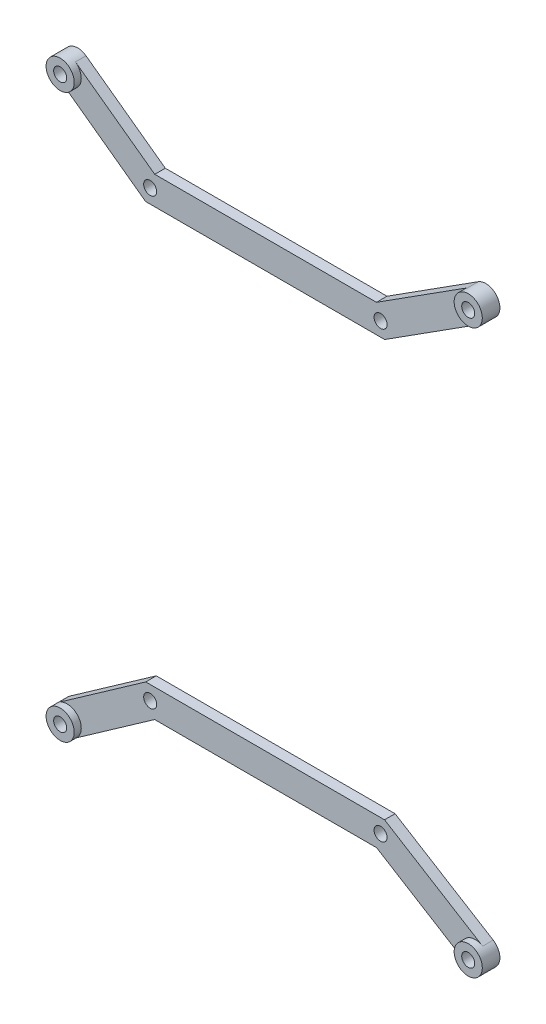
ISO-10303-21;
HEADER;
FILE_DESCRIPTION(('STEP AP214'),'2;1');
FILE_NAME('part.step','',(''),(''),'','','');
FILE_SCHEMA(('AUTOMOTIVE_DESIGN { 1 0 10303 214 1 1 1 1 }'));
ENDSEC;
DATA;
#1=APPLICATION_CONTEXT('core data for automotive mechanical design processes');
#2=APPLICATION_PROTOCOL_DEFINITION('international standard','automotive_design',2000,#1);
#3=PRODUCT_CONTEXT('',#1,'mechanical');
#4=PRODUCT('Part','Part','',(#3));
#5=PRODUCT_RELATED_PRODUCT_CATEGORY('part','',(#4));
#6=PRODUCT_DEFINITION_FORMATION('','',#4);
#7=PRODUCT_DEFINITION_CONTEXT('part definition',#1,'design');
#8=PRODUCT_DEFINITION('design','',#6,#7);
#9=PRODUCT_DEFINITION_SHAPE('','',#8);
#10=(LENGTH_UNIT() NAMED_UNIT(*) SI_UNIT(.MILLI.,.METRE.));
#11=(NAMED_UNIT(*) PLANE_ANGLE_UNIT() SI_UNIT($,.RADIAN.));
#12=(NAMED_UNIT(*) SI_UNIT($,.STERADIAN.) SOLID_ANGLE_UNIT());
#13=UNCERTAINTY_MEASURE_WITH_UNIT(LENGTH_MEASURE(1.E-05),#10,'distance_accuracy_value','');
#14=(GEOMETRIC_REPRESENTATION_CONTEXT(3) GLOBAL_UNCERTAINTY_ASSIGNED_CONTEXT((#13)) GLOBAL_UNIT_ASSIGNED_CONTEXT((#10,
#11,#12)) REPRESENTATION_CONTEXT('',''));
#15=CARTESIAN_POINT('',(0.,0.,0.));
#16=DIRECTION('',(0.,0.,1.));
#17=DIRECTION('',(1.,0.,0.));
#18=AXIS2_PLACEMENT_3D('',#15,#16,#17);
#19=CARTESIAN_POINT('',(58.633927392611,81.359461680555,0.));
#20=DIRECTION('',(0.,0.,-1.));
#21=DIRECTION('',(-1.,0.,0.));
#22=AXIS2_PLACEMENT_3D('',#19,#20,#21);
#23=PLANE('',#22);
#24=CARTESIAN_POINT('',(-33.7767777,64.19002176,0.));
#25=DIRECTION('',(0.,0.,1.));
#26=DIRECTION('',(-1.,0.,0.));
#27=AXIS2_PLACEMENT_3D('',#24,#25,#26);
#28=CIRCLE('',#27,1.85000000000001);
#29=CARTESIAN_POINT('',(-35.6267777,64.19002176,0.));
#30=VERTEX_POINT('',#29);
#31=EDGE_CURVE('E58',#30,#30,#28,.T.);
#32=ORIENTED_EDGE('',*,*,#31,.F.);
#33=EDGE_LOOP('',(#32));
#34=FACE_BOUND('',#33,.T.);
#35=CARTESIAN_POINT('',(31.7132223,64.19002176,0.));
#36=DIRECTION('',(0.,0.,1.));
#37=DIRECTION('',(-1.,0.,0.));
#38=AXIS2_PLACEMENT_3D('',#35,#36,#37);
#39=CIRCLE('',#38,1.85000000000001);
#40=CARTESIAN_POINT('',(29.8632223,64.19002176,0.));
#41=VERTEX_POINT('',#40);
#42=EDGE_CURVE('E174',#41,#41,#39,.T.);
#43=ORIENTED_EDGE('',*,*,#42,.F.);
#44=EDGE_LOOP('',(#43));
#45=FACE_BOUND('',#44,.T.);
#46=CARTESIAN_POINT('',(-57.366072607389,81.359461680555,0.));
#47=DIRECTION('',(0.,0.,1.));
#48=DIRECTION('',(1.,0.,0.));
#49=AXIS2_PLACEMENT_3D('',#46,#47,#48);
#50=CIRCLE('',#49,4.00000000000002);
#51=CARTESIAN_POINT('',(-59.7199777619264,78.1254037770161,0.));
#52=VERTEX_POINT('',#51);
#53=CARTESIAN_POINT('',(-55.0121674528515,84.5935195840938,0.));
#54=VERTEX_POINT('',#53);
#55=EDGE_CURVE('E254',#52,#54,#50,.T.);
#56=ORIENTED_EDGE('',*,*,#55,.F.);
#57=DIRECTION('',(0.808514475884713,-0.588476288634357,0.));
#58=VECTOR('',#57,1.);
#59=CARTESIAN_POINT('',(-35.0783460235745,60.19002176,0.));
#60=LINE('',#59,#58);
#61=CARTESIAN_POINT('',(-35.0783460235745,60.19002176,0.));
#62=VERTEX_POINT('',#61);
#63=EDGE_CURVE('E145',#52,#62,#60,.T.);
#64=ORIENTED_EDGE('',*,*,#63,.T.);
#65=DIRECTION('',(1.,0.,0.));
#66=VECTOR('',#65,1.);
#67=CARTESIAN_POINT('',(32.8802084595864,60.19002176,0.));
#68=LINE('',#67,#66);
#69=CARTESIAN_POINT('',(32.8802084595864,60.19002176,0.));
#70=VERTEX_POINT('',#69);
#71=EDGE_CURVE('E126',#62,#70,#68,.T.);
#72=ORIENTED_EDGE('',*,*,#71,.T.);
#73=DIRECTION('',(0.843120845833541,0.537724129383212,0.));
#74=VECTOR('',#73,1.);
#75=CARTESIAN_POINT('',(60.7848239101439,77.9869782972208,0.));
#76=LINE('',#75,#74);
#77=CARTESIAN_POINT('',(60.7848239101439,77.9869782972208,0.));
#78=VERTEX_POINT('',#77);
#79=EDGE_CURVE('E137',#70,#78,#76,.T.);
#80=ORIENTED_EDGE('',*,*,#79,.T.);
#81=CARTESIAN_POINT('',(58.633927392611,81.359461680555,0.));
#82=DIRECTION('',(0.,0.,1.));
#83=DIRECTION('',(1.,0.,0.));
#84=AXIS2_PLACEMENT_3D('',#81,#82,#83);
#85=CIRCLE('',#84,4.00000000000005);
#86=CARTESIAN_POINT('',(56.4830308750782,84.7319450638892,0.));
#87=VERTEX_POINT('',#86);
#88=EDGE_CURVE('E257',#87,#78,#85,.T.);
#89=ORIENTED_EDGE('',*,*,#88,.F.);
#90=DIRECTION('',(-0.843120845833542,-0.537724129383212,0.));
#91=VECTOR('',#90,1.);
#92=CARTESIAN_POINT('',(30.5462361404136,68.19002176,0.));
#93=LINE('',#92,#91);
#94=CARTESIAN_POINT('',(30.5462361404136,68.19002176,0.));
#95=VERTEX_POINT('',#94);
#96=EDGE_CURVE('E142',#87,#95,#93,.T.);
#97=ORIENTED_EDGE('',*,*,#96,.T.);
#98=DIRECTION('',(-1.,0.,0.));
#99=VECTOR('',#98,1.);
#100=CARTESIAN_POINT('',(-32.4752093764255,68.19002176,0.));
#101=LINE('',#100,#99);
#102=CARTESIAN_POINT('',(-32.4752093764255,68.19002176,0.));
#103=VERTEX_POINT('',#102);
#104=EDGE_CURVE('E170',#95,#103,#101,.T.);
#105=ORIENTED_EDGE('',*,*,#104,.T.);
#106=DIRECTION('',(-0.808514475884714,0.588476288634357,0.));
#107=VECTOR('',#106,1.);
#108=CARTESIAN_POINT('',(-55.0121674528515,84.5935195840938,0.));
#109=LINE('',#108,#107);
#110=EDGE_CURVE('E147',#103,#54,#109,.T.);
#111=ORIENTED_EDGE('',*,*,#110,.T.);
#112=EDGE_LOOP('',(#56,#64,#72,#80,#89,#97,#105,#111));
#113=FACE_BOUND('',#112,.T.);
#114=ADVANCED_FACE('F49',(#34,#45,#113),#23,.F.);
#115=CARTESIAN_POINT('',(-55.0121674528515,84.5935195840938,-3.));
#116=DIRECTION('',(0.588476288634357,0.808514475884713,0.));
#117=DIRECTION('',(-0.808514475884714,0.588476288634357,0.));
#118=AXIS2_PLACEMENT_3D('',#115,#116,#117);
#119=PLANE('',#118);
#120=ORIENTED_EDGE('',*,*,#110,.F.);
#121=DIRECTION('',(0.,0.,1.));
#122=VECTOR('',#121,1.);
#123=CARTESIAN_POINT('',(-32.4752093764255,68.19002176,-3.));
#124=LINE('',#123,#122);
#125=CARTESIAN_POINT('',(-32.4752093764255,68.19002176,-3.));
#126=VERTEX_POINT('',#125);
#127=EDGE_CURVE('E110',#126,#103,#124,.T.);
#128=ORIENTED_EDGE('',*,*,#127,.F.);
#129=DIRECTION('',(-0.808514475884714,0.588476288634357,0.));
#130=VECTOR('',#129,1.);
#131=CARTESIAN_POINT('',(-55.0121674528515,84.5935195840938,-3.));
#132=LINE('',#131,#130);
#133=CARTESIAN_POINT('',(-55.0121674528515,84.5935195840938,-3.));
#134=VERTEX_POINT('',#133);
#135=EDGE_CURVE('E168',#126,#134,#132,.T.);
#136=ORIENTED_EDGE('',*,*,#135,.T.);
#137=DIRECTION('',(0.,0.,1.));
#138=VECTOR('',#137,1.);
#139=CARTESIAN_POINT('',(-55.0121674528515,84.5935195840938,-3.));
#140=LINE('',#139,#138);
#141=EDGE_CURVE('E66',#134,#54,#140,.T.);
#142=ORIENTED_EDGE('',*,*,#141,.T.);
#143=EDGE_LOOP('',(#120,#128,#136,#142));
#144=FACE_BOUND('',#143,.T.);
#145=ADVANCED_FACE('F195',(#144),#119,.T.);
#146=CARTESIAN_POINT('',(-32.4752093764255,68.19002176,-3.));
#147=DIRECTION('',(0.,1.,0.));
#148=DIRECTION('',(0.,0.,1.));
#149=AXIS2_PLACEMENT_3D('',#146,#147,#148);
#150=PLANE('',#149);
#151=ORIENTED_EDGE('',*,*,#104,.F.);
#152=DIRECTION('',(0.,0.,1.));
#153=VECTOR('',#152,1.);
#154=CARTESIAN_POINT('',(30.5462361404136,68.19002176,-3.));
#155=LINE('',#154,#153);
#156=CARTESIAN_POINT('',(30.5462361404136,68.19002176,-3.));
#157=VERTEX_POINT('',#156);
#158=EDGE_CURVE('E273',#157,#95,#155,.T.);
#159=ORIENTED_EDGE('',*,*,#158,.F.);
#160=DIRECTION('',(-1.,0.,0.));
#161=VECTOR('',#160,1.);
#162=CARTESIAN_POINT('',(-32.4752093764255,68.19002176,-3.));
#163=LINE('',#162,#161);
#164=EDGE_CURVE('E153',#157,#126,#163,.T.);
#165=ORIENTED_EDGE('',*,*,#164,.T.);
#166=ORIENTED_EDGE('',*,*,#127,.T.);
#167=EDGE_LOOP('',(#151,#159,#165,#166));
#168=FACE_BOUND('',#167,.T.);
#169=ADVANCED_FACE('F214',(#168),#150,.T.);
#170=CARTESIAN_POINT('',(30.5462361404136,68.19002176,-3.));
#171=DIRECTION('',(-0.537724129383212,0.843120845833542,0.));
#172=DIRECTION('',(-0.843120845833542,-0.537724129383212,0.));
#173=AXIS2_PLACEMENT_3D('',#170,#171,#172);
#174=PLANE('',#173);
#175=ORIENTED_EDGE('',*,*,#96,.F.);
#176=DIRECTION('',(0.,0.,1.));
#177=VECTOR('',#176,1.);
#178=CARTESIAN_POINT('',(56.4830308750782,84.7319450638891,-3.));
#179=LINE('',#178,#177);
#180=CARTESIAN_POINT('',(56.4830308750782,84.7319450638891,-3.));
#181=VERTEX_POINT('',#180);
#182=EDGE_CURVE('E270',#181,#87,#179,.T.);
#183=ORIENTED_EDGE('',*,*,#182,.F.);
#184=DIRECTION('',(-0.843120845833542,-0.537724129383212,0.));
#185=VECTOR('',#184,1.);
#186=CARTESIAN_POINT('',(30.5462361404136,68.19002176,-3.));
#187=LINE('',#186,#185);
#188=EDGE_CURVE('E155',#181,#157,#187,.T.);
#189=ORIENTED_EDGE('',*,*,#188,.T.);
#190=ORIENTED_EDGE('',*,*,#158,.T.);
#191=EDGE_LOOP('',(#175,#183,#189,#190));
#192=FACE_BOUND('',#191,.T.);
#193=ADVANCED_FACE('F217',(#192),#174,.T.);
#194=CARTESIAN_POINT('',(58.633927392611,81.359461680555,-3.));
#195=DIRECTION('',(0.,0.,1.));
#196=DIRECTION('',(1.,0.,0.));
#197=AXIS2_PLACEMENT_3D('',#194,#195,#196);
#198=CYLINDRICAL_SURFACE('',#197,4.);
#199=ORIENTED_EDGE('',*,*,#182,.T.);
#200=ORIENTED_EDGE('',*,*,#88,.T.);
#201=DIRECTION('',(0.,0.,1.));
#202=VECTOR('',#201,1.);
#203=CARTESIAN_POINT('',(60.7848239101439,77.9869782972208,-3.));
#204=LINE('',#203,#202);
#205=CARTESIAN_POINT('',(60.7848239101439,77.9869782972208,-3.));
#206=VERTEX_POINT('',#205);
#207=EDGE_CURVE('E134',#206,#78,#204,.T.);
#208=ORIENTED_EDGE('',*,*,#207,.F.);
#209=CARTESIAN_POINT('',(58.633927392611,81.359461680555,-3.));
#210=DIRECTION('',(0.,0.,1.));
#211=DIRECTION('',(-1.,0.,0.));
#212=AXIS2_PLACEMENT_3D('',#209,#210,#211);
#213=CIRCLE('',#212,4.);
#214=EDGE_CURVE('E158',#206,#181,#213,.T.);
#215=ORIENTED_EDGE('',*,*,#214,.T.);
#216=EDGE_LOOP('',(#199,#200,#208,#215));
#217=FACE_BOUND('',#216,.T.);
#218=CARTESIAN_POINT('',(58.633927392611,81.359461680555,2.));
#219=DIRECTION('',(0.,0.,1.));
#220=DIRECTION('',(1.,0.,0.));
#221=AXIS2_PLACEMENT_3D('',#218,#219,#220);
#222=CIRCLE('',#221,4.00000000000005);
#223=CARTESIAN_POINT('',(62.6339273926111,81.359461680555,2.));
#224=VERTEX_POINT('',#223);
#225=EDGE_CURVE('E253',#224,#224,#222,.T.);
#226=ORIENTED_EDGE('',*,*,#225,.F.);
#227=EDGE_LOOP('',(#226));
#228=FACE_BOUND('',#227,.T.);
#229=ADVANCED_FACE('F220',(#217,#228),#198,.T.);
#230=CARTESIAN_POINT('',(60.7848239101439,77.9869782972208,-3.));
#231=DIRECTION('',(0.537724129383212,-0.843120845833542,0.));
#232=DIRECTION('',(0.843120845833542,0.537724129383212,0.));
#233=AXIS2_PLACEMENT_3D('',#230,#231,#232);
#234=PLANE('',#233);
#235=ORIENTED_EDGE('',*,*,#79,.F.);
#236=DIRECTION('',(0.,0.,1.));
#237=VECTOR('',#236,1.);
#238=CARTESIAN_POINT('',(32.8802084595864,60.19002176,-3.));
#239=LINE('',#238,#237);
#240=CARTESIAN_POINT('',(32.8802084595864,60.19002176,-3.));
#241=VERTEX_POINT('',#240);
#242=EDGE_CURVE('E122',#241,#70,#239,.T.);
#243=ORIENTED_EDGE('',*,*,#242,.F.);
#244=DIRECTION('',(0.843120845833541,0.537724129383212,0.));
#245=VECTOR('',#244,1.);
#246=CARTESIAN_POINT('',(60.7848239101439,77.9869782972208,-3.));
#247=LINE('',#246,#245);
#248=EDGE_CURVE('E161',#241,#206,#247,.T.);
#249=ORIENTED_EDGE('',*,*,#248,.T.);
#250=ORIENTED_EDGE('',*,*,#207,.T.);
#251=EDGE_LOOP('',(#235,#243,#249,#250));
#252=FACE_BOUND('',#251,.T.);
#253=ADVANCED_FACE('F138',(#252),#234,.T.);
#254=CARTESIAN_POINT('',(32.8802084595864,60.19002176,-3.));
#255=DIRECTION('',(0.,-1.,0.));
#256=DIRECTION('',(0.,0.,-1.));
#257=AXIS2_PLACEMENT_3D('',#254,#255,#256);
#258=PLANE('',#257);
#259=ORIENTED_EDGE('',*,*,#71,.F.);
#260=DIRECTION('',(0.,0.,1.));
#261=VECTOR('',#260,1.);
#262=CARTESIAN_POINT('',(-35.0783460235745,60.19002176,-3.));
#263=LINE('',#262,#261);
#264=CARTESIAN_POINT('',(-35.0783460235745,60.19002176,-3.));
#265=VERTEX_POINT('',#264);
#266=EDGE_CURVE('E133',#265,#62,#263,.T.);
#267=ORIENTED_EDGE('',*,*,#266,.F.);
#268=DIRECTION('',(1.,0.,0.));
#269=VECTOR('',#268,1.);
#270=CARTESIAN_POINT('',(32.8802084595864,60.19002176,-3.));
#271=LINE('',#270,#269);
#272=EDGE_CURVE('E129',#265,#241,#271,.T.);
#273=ORIENTED_EDGE('',*,*,#272,.T.);
#274=ORIENTED_EDGE('',*,*,#242,.T.);
#275=EDGE_LOOP('',(#259,#267,#273,#274));
#276=FACE_BOUND('',#275,.T.);
#277=ADVANCED_FACE('F124',(#276),#258,.T.);
#278=CARTESIAN_POINT('',(-35.0783460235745,60.19002176,-3.));
#279=DIRECTION('',(-0.588476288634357,-0.808514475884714,0.));
#280=DIRECTION('',(0.808514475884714,-0.588476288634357,0.));
#281=AXIS2_PLACEMENT_3D('',#278,#279,#280);
#282=PLANE('',#281);
#283=ORIENTED_EDGE('',*,*,#63,.F.);
#284=DIRECTION('',(0.,0.,1.));
#285=VECTOR('',#284,1.);
#286=CARTESIAN_POINT('',(-59.7199777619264,78.1254037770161,-3.));
#287=LINE('',#286,#285);
#288=CARTESIAN_POINT('',(-59.7199777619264,78.1254037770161,-3.));
#289=VERTEX_POINT('',#288);
#290=EDGE_CURVE('E97',#289,#52,#287,.T.);
#291=ORIENTED_EDGE('',*,*,#290,.F.);
#292=DIRECTION('',(0.808514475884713,-0.588476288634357,0.));
#293=VECTOR('',#292,1.);
#294=CARTESIAN_POINT('',(-35.0783460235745,60.19002176,-3.));
#295=LINE('',#294,#293);
#296=EDGE_CURVE('E164',#289,#265,#295,.T.);
#297=ORIENTED_EDGE('',*,*,#296,.T.);
#298=ORIENTED_EDGE('',*,*,#266,.T.);
#299=EDGE_LOOP('',(#283,#291,#297,#298));
#300=FACE_BOUND('',#299,.T.);
#301=ADVANCED_FACE('F229',(#300),#282,.T.);
#302=CARTESIAN_POINT('',(-57.366072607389,81.359461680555,-3.));
#303=DIRECTION('',(0.,0.,1.));
#304=DIRECTION('',(1.,0.,0.));
#305=AXIS2_PLACEMENT_3D('',#302,#303,#304);
#306=CYLINDRICAL_SURFACE('',#305,4.00000000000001);
#307=ORIENTED_EDGE('',*,*,#290,.T.);
#308=ORIENTED_EDGE('',*,*,#55,.T.);
#309=ORIENTED_EDGE('',*,*,#141,.F.);
#310=CARTESIAN_POINT('',(-57.366072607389,81.359461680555,-3.));
#311=DIRECTION('',(0.,0.,1.));
#312=DIRECTION('',(-1.,0.,0.));
#313=AXIS2_PLACEMENT_3D('',#310,#311,#312);
#314=CIRCLE('',#313,4.00000000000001);
#315=EDGE_CURVE('E166',#134,#289,#314,.T.);
#316=ORIENTED_EDGE('',*,*,#315,.T.);
#317=EDGE_LOOP('',(#307,#308,#309,#316));
#318=FACE_BOUND('',#317,.T.);
#319=CARTESIAN_POINT('',(-57.366072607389,81.359461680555,2.));
#320=DIRECTION('',(0.,0.,1.));
#321=DIRECTION('',(1.,0.,0.));
#322=AXIS2_PLACEMENT_3D('',#319,#320,#321);
#323=CIRCLE('',#322,4.00000000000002);
#324=CARTESIAN_POINT('',(-53.3660726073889,81.359461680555,2.));
#325=VERTEX_POINT('',#324);
#326=EDGE_CURVE('E248',#325,#325,#323,.T.);
#327=ORIENTED_EDGE('',*,*,#326,.F.);
#328=EDGE_LOOP('',(#327));
#329=FACE_BOUND('',#328,.T.);
#330=ADVANCED_FACE('F211',(#318,#329),#306,.T.);
#331=CARTESIAN_POINT('',(58.633927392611,81.359461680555,-3.));
#332=DIRECTION('',(0.,0.,-1.));
#333=DIRECTION('',(-1.,0.,0.));
#334=AXIS2_PLACEMENT_3D('',#331,#332,#333);
#335=PLANE('',#334);
#336=CARTESIAN_POINT('',(-57.366072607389,81.359461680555,-3.));
#337=DIRECTION('',(0.,0.,1.));
#338=DIRECTION('',(1.,0.,0.));
#339=AXIS2_PLACEMENT_3D('',#336,#337,#338);
#340=CIRCLE('',#339,1.85000000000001);
#341=CARTESIAN_POINT('',(-55.516072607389,81.359461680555,-3.));
#342=VERTEX_POINT('',#341);
#343=EDGE_CURVE('E12',#342,#342,#340,.T.);
#344=ORIENTED_EDGE('',*,*,#343,.T.);
#345=EDGE_LOOP('',(#344));
#346=FACE_BOUND('',#345,.T.);
#347=CARTESIAN_POINT('',(-33.7767777,64.19002176,-3.));
#348=DIRECTION('',(0.,0.,1.));
#349=DIRECTION('',(-1.,0.,0.));
#350=AXIS2_PLACEMENT_3D('',#347,#348,#349);
#351=CIRCLE('',#350,1.85000000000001);
#352=CARTESIAN_POINT('',(-35.6267777,64.19002176,-3.));
#353=VERTEX_POINT('',#352);
#354=EDGE_CURVE('E177',#353,#353,#351,.T.);
#355=ORIENTED_EDGE('',*,*,#354,.T.);
#356=EDGE_LOOP('',(#355));
#357=FACE_BOUND('',#356,.T.);
#358=CARTESIAN_POINT('',(31.7132223,64.19002176,-3.));
#359=DIRECTION('',(0.,0.,1.));
#360=DIRECTION('',(-1.,0.,0.));
#361=AXIS2_PLACEMENT_3D('',#358,#359,#360);
#362=CIRCLE('',#361,1.85000000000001);
#363=CARTESIAN_POINT('',(29.8632223,64.19002176,-3.));
#364=VERTEX_POINT('',#363);
#365=EDGE_CURVE('E173',#364,#364,#362,.T.);
#366=ORIENTED_EDGE('',*,*,#365,.T.);
#367=EDGE_LOOP('',(#366));
#368=FACE_BOUND('',#367,.T.);
#369=CARTESIAN_POINT('',(58.633927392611,81.359461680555,-3.));
#370=DIRECTION('',(0.,0.,1.));
#371=DIRECTION('',(1.,0.,0.));
#372=AXIS2_PLACEMENT_3D('',#369,#370,#371);
#373=CIRCLE('',#372,1.85000000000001);
#374=CARTESIAN_POINT('',(60.4839273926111,81.359461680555,-3.));
#375=VERTEX_POINT('',#374);
#376=EDGE_CURVE('E152',#375,#375,#373,.T.);
#377=ORIENTED_EDGE('',*,*,#376,.T.);
#378=EDGE_LOOP('',(#377));
#379=FACE_BOUND('',#378,.T.);
#380=ORIENTED_EDGE('',*,*,#135,.F.);
#381=ORIENTED_EDGE('',*,*,#164,.F.);
#382=ORIENTED_EDGE('',*,*,#188,.F.);
#383=ORIENTED_EDGE('',*,*,#214,.F.);
#384=ORIENTED_EDGE('',*,*,#248,.F.);
#385=ORIENTED_EDGE('',*,*,#272,.F.);
#386=ORIENTED_EDGE('',*,*,#296,.F.);
#387=ORIENTED_EDGE('',*,*,#315,.F.);
#388=EDGE_LOOP('',(#380,#381,#382,#383,#384,#385,#386,#387));
#389=FACE_BOUND('',#388,.T.);
#390=ADVANCED_FACE('F184',(#346,#357,#368,#379,#389),#335,.T.);
#391=CARTESIAN_POINT('',(58.633927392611,81.359461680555,-3.));
#392=DIRECTION('',(0.,0.,1.));
#393=DIRECTION('',(1.,0.,0.));
#394=AXIS2_PLACEMENT_3D('',#391,#392,#393);
#395=CYLINDRICAL_SURFACE('',#394,1.85000000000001);
#396=ORIENTED_EDGE('',*,*,#376,.F.);
#397=EDGE_LOOP('',(#396));
#398=FACE_BOUND('',#397,.T.);
#399=CARTESIAN_POINT('',(58.633927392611,81.359461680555,2.));
#400=DIRECTION('',(0.,0.,1.));
#401=DIRECTION('',(1.,0.,0.));
#402=AXIS2_PLACEMENT_3D('',#399,#400,#401);
#403=CIRCLE('',#402,1.85000000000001);
#404=CARTESIAN_POINT('',(60.4839273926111,81.359461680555,2.));
#405=VERTEX_POINT('',#404);
#406=EDGE_CURVE('E262',#405,#405,#403,.T.);
#407=ORIENTED_EDGE('',*,*,#406,.T.);
#408=EDGE_LOOP('',(#407));
#409=FACE_BOUND('',#408,.T.);
#410=ADVANCED_FACE('F200',(#398,#409),#395,.F.);
#411=CARTESIAN_POINT('',(31.7132223,64.19002176,-3.));
#412=DIRECTION('',(0.,0.,1.));
#413=DIRECTION('',(1.,0.,0.));
#414=AXIS2_PLACEMENT_3D('',#411,#412,#413);
#415=CYLINDRICAL_SURFACE('',#414,1.85000000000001);
#416=ORIENTED_EDGE('',*,*,#365,.F.);
#417=EDGE_LOOP('',(#416));
#418=FACE_BOUND('',#417,.T.);
#419=ORIENTED_EDGE('',*,*,#42,.T.);
#420=EDGE_LOOP('',(#419));
#421=FACE_BOUND('',#420,.T.);
#422=ADVANCED_FACE('F190',(#418,#421),#415,.F.);
#423=CARTESIAN_POINT('',(-33.7767777,64.19002176,-3.));
#424=DIRECTION('',(0.,0.,1.));
#425=DIRECTION('',(1.,0.,0.));
#426=AXIS2_PLACEMENT_3D('',#423,#424,#425);
#427=CYLINDRICAL_SURFACE('',#426,1.85000000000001);
#428=ORIENTED_EDGE('',*,*,#354,.F.);
#429=EDGE_LOOP('',(#428));
#430=FACE_BOUND('',#429,.T.);
#431=ORIENTED_EDGE('',*,*,#31,.T.);
#432=EDGE_LOOP('',(#431));
#433=FACE_BOUND('',#432,.T.);
#434=ADVANCED_FACE('F187',(#430,#433),#427,.F.);
#435=CARTESIAN_POINT('',(-57.366072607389,81.359461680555,-3.));
#436=DIRECTION('',(0.,0.,1.));
#437=DIRECTION('',(1.,0.,0.));
#438=AXIS2_PLACEMENT_3D('',#435,#436,#437);
#439=CYLINDRICAL_SURFACE('',#438,1.85000000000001);
#440=ORIENTED_EDGE('',*,*,#343,.F.);
#441=EDGE_LOOP('',(#440));
#442=FACE_BOUND('',#441,.T.);
#443=CARTESIAN_POINT('',(-57.366072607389,81.359461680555,2.));
#444=DIRECTION('',(0.,0.,1.));
#445=DIRECTION('',(1.,0.,0.));
#446=AXIS2_PLACEMENT_3D('',#443,#444,#445);
#447=CIRCLE('',#446,1.85000000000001);
#448=CARTESIAN_POINT('',(-55.516072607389,81.359461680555,2.));
#449=VERTEX_POINT('',#448);
#450=EDGE_CURVE('E251',#449,#449,#447,.T.);
#451=ORIENTED_EDGE('',*,*,#450,.T.);
#452=EDGE_LOOP('',(#451));
#453=FACE_BOUND('',#452,.T.);
#454=ADVANCED_FACE('F51',(#442,#453),#439,.F.);
#455=CARTESIAN_POINT('',(58.633927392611,81.359461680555,2.));
#456=DIRECTION('',(0.,0.,1.));
#457=DIRECTION('',(1.,0.,0.));
#458=AXIS2_PLACEMENT_3D('',#455,#456,#457);
#459=PLANE('',#458);
#460=ORIENTED_EDGE('',*,*,#225,.T.);
#461=EDGE_LOOP('',(#460));
#462=FACE_BOUND('',#461,.T.);
#463=ORIENTED_EDGE('',*,*,#406,.F.);
#464=EDGE_LOOP('',(#463));
#465=FACE_BOUND('',#464,.T.);
#466=ADVANCED_FACE('F236',(#462,#465),#459,.T.);
#467=CARTESIAN_POINT('',(-57.366072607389,81.359461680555,2.));
#468=DIRECTION('',(0.,0.,1.));
#469=DIRECTION('',(1.,0.,0.));
#470=AXIS2_PLACEMENT_3D('',#467,#468,#469);
#471=PLANE('',#470);
#472=ORIENTED_EDGE('',*,*,#326,.T.);
#473=EDGE_LOOP('',(#472));
#474=FACE_BOUND('',#473,.T.);
#475=ORIENTED_EDGE('',*,*,#450,.F.);
#476=EDGE_LOOP('',(#475));
#477=FACE_BOUND('',#476,.T.);
#478=ADVANCED_FACE('F239',(#474,#477),#471,.T.);
#479=CLOSED_SHELL('',(#114,#145,#169,#193,#229,#253,#277,#301,#330,#390,#410,#422,#434,#454,
#466,#478));
#480=MANIFOLD_SOLID_BREP('B2',#479);
#481=CARTESIAN_POINT('',(-57.366072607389,-78.640538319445,0.));
#482=DIRECTION('',(0.,0.,1.));
#483=DIRECTION('',(1.,0.,0.));
#484=AXIS2_PLACEMENT_3D('',#481,#482,#483);
#485=PLANE('',#484);
#486=CARTESIAN_POINT('',(-33.7767777,-62.05997824,0.));
#487=DIRECTION('',(0.,0.,1.));
#488=DIRECTION('',(1.,0.,0.));
#489=AXIS2_PLACEMENT_3D('',#486,#487,#488);
#490=CIRCLE('',#489,1.85000000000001);
#491=CARTESIAN_POINT('',(-31.9267777,-62.05997824,0.));
#492=VERTEX_POINT('',#491);
#493=EDGE_CURVE('E607',#492,#492,#490,.T.);
#494=ORIENTED_EDGE('',*,*,#493,.F.);
#495=EDGE_LOOP('',(#494));
#496=FACE_BOUND('',#495,.T.);
#497=CARTESIAN_POINT('',(31.7132223,-62.05997824,0.));
#498=DIRECTION('',(0.,0.,1.));
#499=DIRECTION('',(1.,0.,0.));
#500=AXIS2_PLACEMENT_3D('',#497,#498,#499);
#501=CIRCLE('',#500,1.85);
#502=CARTESIAN_POINT('',(33.5632223,-62.05997824,0.));
#503=VERTEX_POINT('',#502);
#504=EDGE_CURVE('E603',#503,#503,#501,.T.);
#505=ORIENTED_EDGE('',*,*,#504,.F.);
#506=EDGE_LOOP('',(#505));
#507=FACE_BOUND('',#506,.T.);
#508=DIRECTION('',(0.851461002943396,-0.524417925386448,0.));
#509=VECTOR('',#508,1.);
#510=CARTESIAN_POINT('',(30.580240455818,-66.05997824,0.));
#511=LINE('',#510,#509);
#512=CARTESIAN_POINT('',(30.580240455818,-66.05997824,0.));
#513=VERTEX_POINT('',#512);
#514=CARTESIAN_POINT('',(56.5362556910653,-82.0463823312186,0.));
#515=VERTEX_POINT('',#514);
#516=EDGE_CURVE('E513',#513,#515,#511,.T.);
#517=ORIENTED_EDGE('',*,*,#516,.T.);
#518=CARTESIAN_POINT('',(58.6339273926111,-78.640538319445,0.));
#519=DIRECTION('',(0.,0.,1.));
#520=DIRECTION('',(1.,0.,0.));
#521=AXIS2_PLACEMENT_3D('',#518,#519,#520);
#522=CIRCLE('',#521,4.00000000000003);
#523=CARTESIAN_POINT('',(60.7315990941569,-75.2346943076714,0.));
#524=VERTEX_POINT('',#523);
#525=EDGE_CURVE('E587',#524,#515,#522,.T.);
#526=ORIENTED_EDGE('',*,*,#525,.F.);
#527=DIRECTION('',(-0.851461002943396,0.524417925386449,0.));
#528=VECTOR('',#527,1.);
#529=CARTESIAN_POINT('',(60.7315990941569,-75.2346943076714,0.));
#530=LINE('',#529,#528);
#531=CARTESIAN_POINT('',(32.846204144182,-58.05997824,0.));
#532=VERTEX_POINT('',#531);
#533=EDGE_CURVE('E479',#524,#532,#530,.T.);
#534=ORIENTED_EDGE('',*,*,#533,.T.);
#535=DIRECTION('',(-1.,0.,0.));
#536=VECTOR('',#535,1.);
#537=CARTESIAN_POINT('',(32.846204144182,-58.05997824,0.));
#538=LINE('',#537,#536);
#539=CARTESIAN_POINT('',(-35.0419193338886,-58.05997824,0.));
#540=VERTEX_POINT('',#539);
#541=EDGE_CURVE('E517',#532,#540,#538,.T.);
#542=ORIENTED_EDGE('',*,*,#541,.T.);
#543=DIRECTION('',(-0.818121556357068,-0.575045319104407,0.));
#544=VECTOR('',#543,1.);
#545=CARTESIAN_POINT('',(-35.0419193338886,-58.05997824,0.));
#546=LINE('',#545,#544);
#547=CARTESIAN_POINT('',(-59.6662538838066,-75.3680520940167,0.));
#548=VERTEX_POINT('',#547);
#549=EDGE_CURVE('E503',#540,#548,#546,.T.);
#550=ORIENTED_EDGE('',*,*,#549,.T.);
#551=CARTESIAN_POINT('',(-57.366072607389,-78.640538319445,0.));
#552=DIRECTION('',(0.,0.,1.));
#553=DIRECTION('',(1.,0.,0.));
#554=AXIS2_PLACEMENT_3D('',#551,#552,#553);
#555=CIRCLE('',#554,4.00000000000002);
#556=CARTESIAN_POINT('',(-55.0658913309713,-81.9130245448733,0.));
#557=VERTEX_POINT('',#556);
#558=EDGE_CURVE('E47',#557,#548,#555,.T.);
#559=ORIENTED_EDGE('',*,*,#558,.F.);
#560=DIRECTION('',(0.818121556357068,0.575045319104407,0.));
#561=VECTOR('',#560,1.);
#562=CARTESIAN_POINT('',(-55.0658913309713,-81.9130245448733,0.));
#563=LINE('',#562,#561);
#564=CARTESIAN_POINT('',(-32.5116360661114,-66.05997824,0.));
#565=VERTEX_POINT('',#564);
#566=EDGE_CURVE('E506',#557,#565,#563,.T.);
#567=ORIENTED_EDGE('',*,*,#566,.T.);
#568=DIRECTION('',(1.,0.,0.));
#569=VECTOR('',#568,1.);
#570=CARTESIAN_POINT('',(-32.5116360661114,-66.05997824,0.));
#571=LINE('',#570,#569);
#572=EDGE_CURVE('E510',#565,#513,#571,.T.);
#573=ORIENTED_EDGE('',*,*,#572,.T.);
#574=EDGE_LOOP('',(#517,#526,#534,#542,#550,#559,#567,#573));
#575=FACE_BOUND('',#574,.T.);
#576=ADVANCED_FACE('F403',(#496,#507,#575),#485,.T.);
#577=CARTESIAN_POINT('',(-35.0419193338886,-58.05997824,-3.));
#578=DIRECTION('',(-0.575045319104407,0.818121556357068,0.));
#579=DIRECTION('',(-0.818121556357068,-0.575045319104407,0.));
#580=AXIS2_PLACEMENT_3D('',#577,#578,#579);
#581=PLANE('',#580);
#582=ORIENTED_EDGE('',*,*,#549,.F.);
#583=DIRECTION('',(0.,0.,1.));
#584=VECTOR('',#583,1.);
#585=CARTESIAN_POINT('',(-35.0419193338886,-58.05997824,-3.));
#586=LINE('',#585,#584);
#587=CARTESIAN_POINT('',(-35.0419193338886,-58.05997824,-3.));
#588=VERTEX_POINT('',#587);
#589=EDGE_CURVE('E413',#588,#540,#586,.T.);
#590=ORIENTED_EDGE('',*,*,#589,.F.);
#591=DIRECTION('',(-0.818121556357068,-0.575045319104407,0.));
#592=VECTOR('',#591,1.);
#593=CARTESIAN_POINT('',(-35.0419193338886,-58.05997824,-3.));
#594=LINE('',#593,#592);
#595=CARTESIAN_POINT('',(-59.6662538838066,-75.3680520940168,-3.));
#596=VERTEX_POINT('',#595);
#597=EDGE_CURVE('E520',#588,#596,#594,.T.);
#598=ORIENTED_EDGE('',*,*,#597,.T.);
#599=DIRECTION('',(0.,0.,1.));
#600=VECTOR('',#599,1.);
#601=CARTESIAN_POINT('',(-59.6662538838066,-75.3680520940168,-3.));
#602=LINE('',#601,#600);
#603=EDGE_CURVE('E407',#596,#548,#602,.T.);
#604=ORIENTED_EDGE('',*,*,#603,.T.);
#605=EDGE_LOOP('',(#582,#590,#598,#604));
#606=FACE_BOUND('',#605,.T.);
#607=ADVANCED_FACE('F405',(#606),#581,.T.);
#608=CARTESIAN_POINT('',(32.846204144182,-58.05997824,-3.));
#609=DIRECTION('',(0.,1.,0.));
#610=DIRECTION('',(-1.,0.,0.));
#611=AXIS2_PLACEMENT_3D('',#608,#609,#610);
#612=PLANE('',#611);
#613=ORIENTED_EDGE('',*,*,#541,.F.);
#614=DIRECTION('',(0.,0.,1.));
#615=VECTOR('',#614,1.);
#616=CARTESIAN_POINT('',(32.846204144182,-58.05997824,-3.));
#617=LINE('',#616,#615);
#618=CARTESIAN_POINT('',(32.846204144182,-58.05997824,-3.));
#619=VERTEX_POINT('',#618);
#620=EDGE_CURVE('E445',#619,#532,#617,.T.);
#621=ORIENTED_EDGE('',*,*,#620,.F.);
#622=DIRECTION('',(-1.,0.,0.));
#623=VECTOR('',#622,1.);
#624=CARTESIAN_POINT('',(32.846204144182,-58.05997824,-3.));
#625=LINE('',#624,#623);
#626=EDGE_CURVE('E492',#619,#588,#625,.T.);
#627=ORIENTED_EDGE('',*,*,#626,.T.);
#628=ORIENTED_EDGE('',*,*,#589,.T.);
#629=EDGE_LOOP('',(#613,#621,#627,#628));
#630=FACE_BOUND('',#629,.T.);
#631=ADVANCED_FACE('F533',(#630),#612,.T.);
#632=CARTESIAN_POINT('',(60.7315990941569,-75.2346943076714,-3.));
#633=DIRECTION('',(0.524417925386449,0.851461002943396,0.));
#634=DIRECTION('',(-0.851461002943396,0.524417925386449,0.));
#635=AXIS2_PLACEMENT_3D('',#632,#633,#634);
#636=PLANE('',#635);
#637=ORIENTED_EDGE('',*,*,#533,.F.);
#638=DIRECTION('',(0.,0.,1.));
#639=VECTOR('',#638,1.);
#640=CARTESIAN_POINT('',(60.7315990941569,-75.2346943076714,-3.));
#641=LINE('',#640,#639);
#642=CARTESIAN_POINT('',(60.7315990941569,-75.2346943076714,-3.));
#643=VERTEX_POINT('',#642);
#644=EDGE_CURVE('E473',#643,#524,#641,.T.);
#645=ORIENTED_EDGE('',*,*,#644,.F.);
#646=DIRECTION('',(-0.851461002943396,0.524417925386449,0.));
#647=VECTOR('',#646,1.);
#648=CARTESIAN_POINT('',(60.7315990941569,-75.2346943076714,-3.));
#649=LINE('',#648,#647);
#650=EDGE_CURVE('E476',#643,#619,#649,.T.);
#651=ORIENTED_EDGE('',*,*,#650,.T.);
#652=ORIENTED_EDGE('',*,*,#620,.T.);
#653=EDGE_LOOP('',(#637,#645,#651,#652));
#654=FACE_BOUND('',#653,.T.);
#655=ADVANCED_FACE('F475',(#654),#636,.T.);
#656=CARTESIAN_POINT('',(58.6339273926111,-78.640538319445,-3.));
#657=DIRECTION('',(0.,0.,1.));
#658=DIRECTION('',(1.,0.,0.));
#659=AXIS2_PLACEMENT_3D('',#656,#657,#658);
#660=CYLINDRICAL_SURFACE('',#659,3.99999999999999);
#661=ORIENTED_EDGE('',*,*,#644,.T.);
#662=ORIENTED_EDGE('',*,*,#525,.T.);
#663=DIRECTION('',(0.,0.,1.));
#664=VECTOR('',#663,1.);
#665=CARTESIAN_POINT('',(56.5362556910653,-82.0463823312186,-3.));
#666=LINE('',#665,#664);
#667=CARTESIAN_POINT('',(56.5362556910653,-82.0463823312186,-3.));
#668=VERTEX_POINT('',#667);
#669=EDGE_CURVE('E484',#668,#515,#666,.T.);
#670=ORIENTED_EDGE('',*,*,#669,.F.);
#671=CARTESIAN_POINT('',(58.6339273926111,-78.640538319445,-3.));
#672=DIRECTION('',(0.,0.,1.));
#673=DIRECTION('',(1.,0.,0.));
#674=AXIS2_PLACEMENT_3D('',#671,#672,#673);
#675=CIRCLE('',#674,3.99999999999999);
#676=EDGE_CURVE('E490',#668,#643,#675,.T.);
#677=ORIENTED_EDGE('',*,*,#676,.T.);
#678=EDGE_LOOP('',(#661,#662,#670,#677));
#679=FACE_BOUND('',#678,.T.);
#680=CARTESIAN_POINT('',(58.6339273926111,-78.640538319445,2.));
#681=DIRECTION('',(0.,0.,1.));
#682=DIRECTION('',(1.,0.,0.));
#683=AXIS2_PLACEMENT_3D('',#680,#681,#682);
#684=CIRCLE('',#683,4.00000000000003);
#685=CARTESIAN_POINT('',(62.6339273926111,-78.640538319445,2.));
#686=VERTEX_POINT('',#685);
#687=EDGE_CURVE('E581',#686,#686,#684,.T.);
#688=ORIENTED_EDGE('',*,*,#687,.F.);
#689=EDGE_LOOP('',(#688));
#690=FACE_BOUND('',#689,.T.);
#691=ADVANCED_FACE('F494',(#679,#690),#660,.T.);
#692=CARTESIAN_POINT('',(30.580240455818,-66.05997824,-3.));
#693=DIRECTION('',(-0.524417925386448,-0.851461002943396,0.));
#694=DIRECTION('',(0.851461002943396,-0.524417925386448,0.));
#695=AXIS2_PLACEMENT_3D('',#692,#693,#694);
#696=PLANE('',#695);
#697=ORIENTED_EDGE('',*,*,#516,.F.);
#698=DIRECTION('',(0.,0.,1.));
#699=VECTOR('',#698,1.);
#700=CARTESIAN_POINT('',(30.580240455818,-66.05997824,-3.));
#701=LINE('',#700,#699);
#702=CARTESIAN_POINT('',(30.580240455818,-66.05997824,-3.));
#703=VERTEX_POINT('',#702);
#704=EDGE_CURVE('E524',#703,#513,#701,.T.);
#705=ORIENTED_EDGE('',*,*,#704,.F.);
#706=DIRECTION('',(0.851461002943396,-0.524417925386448,0.));
#707=VECTOR('',#706,1.);
#708=CARTESIAN_POINT('',(30.580240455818,-66.05997824,-3.));
#709=LINE('',#708,#707);
#710=EDGE_CURVE('E496',#703,#668,#709,.T.);
#711=ORIENTED_EDGE('',*,*,#710,.T.);
#712=ORIENTED_EDGE('',*,*,#669,.T.);
#713=EDGE_LOOP('',(#697,#705,#711,#712));
#714=FACE_BOUND('',#713,.T.);
#715=ADVANCED_FACE('F629',(#714),#696,.T.);
#716=CARTESIAN_POINT('',(-32.5116360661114,-66.05997824,-3.));
#717=DIRECTION('',(0.,-1.,0.));
#718=DIRECTION('',(0.,0.,-1.));
#719=AXIS2_PLACEMENT_3D('',#716,#717,#718);
#720=PLANE('',#719);
#721=ORIENTED_EDGE('',*,*,#572,.F.);
#722=DIRECTION('',(0.,0.,1.));
#723=VECTOR('',#722,1.);
#724=CARTESIAN_POINT('',(-32.5116360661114,-66.05997824,-3.));
#725=LINE('',#724,#723);
#726=CARTESIAN_POINT('',(-32.5116360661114,-66.05997824,-3.));
#727=VERTEX_POINT('',#726);
#728=EDGE_CURVE('E526',#727,#565,#725,.T.);
#729=ORIENTED_EDGE('',*,*,#728,.F.);
#730=DIRECTION('',(1.,0.,0.));
#731=VECTOR('',#730,1.);
#732=CARTESIAN_POINT('',(-32.5116360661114,-66.05997824,-3.));
#733=LINE('',#732,#731);
#734=EDGE_CURVE('E498',#727,#703,#733,.T.);
#735=ORIENTED_EDGE('',*,*,#734,.T.);
#736=ORIENTED_EDGE('',*,*,#704,.T.);
#737=EDGE_LOOP('',(#721,#729,#735,#736));
#738=FACE_BOUND('',#737,.T.);
#739=ADVANCED_FACE('F623',(#738),#720,.T.);
#740=CARTESIAN_POINT('',(-55.0658913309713,-81.9130245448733,-3.));
#741=DIRECTION('',(0.575045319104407,-0.818121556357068,0.));
#742=DIRECTION('',(0.818121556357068,0.575045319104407,0.));
#743=AXIS2_PLACEMENT_3D('',#740,#741,#742);
#744=PLANE('',#743);
#745=ORIENTED_EDGE('',*,*,#566,.F.);
#746=DIRECTION('',(0.,0.,1.));
#747=VECTOR('',#746,1.);
#748=CARTESIAN_POINT('',(-55.0658913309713,-81.9130245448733,-3.));
#749=LINE('',#748,#747);
#750=CARTESIAN_POINT('',(-55.0658913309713,-81.9130245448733,-3.));
#751=VERTEX_POINT('',#750);
#752=EDGE_CURVE('E527',#751,#557,#749,.T.);
#753=ORIENTED_EDGE('',*,*,#752,.F.);
#754=DIRECTION('',(0.818121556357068,0.575045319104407,0.));
#755=VECTOR('',#754,1.);
#756=CARTESIAN_POINT('',(-55.0658913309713,-81.9130245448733,-3.));
#757=LINE('',#756,#755);
#758=EDGE_CURVE('E617',#751,#727,#757,.T.);
#759=ORIENTED_EDGE('',*,*,#758,.T.);
#760=ORIENTED_EDGE('',*,*,#728,.T.);
#761=EDGE_LOOP('',(#745,#753,#759,#760));
#762=FACE_BOUND('',#761,.T.);
#763=ADVANCED_FACE('F627',(#762),#744,.T.);
#764=CARTESIAN_POINT('',(-57.366072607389,-78.640538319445,-3.));
#765=DIRECTION('',(0.,0.,1.));
#766=DIRECTION('',(1.,0.,0.));
#767=AXIS2_PLACEMENT_3D('',#764,#765,#766);
#768=CYLINDRICAL_SURFACE('',#767,4.);
#769=ORIENTED_EDGE('',*,*,#752,.T.);
#770=ORIENTED_EDGE('',*,*,#558,.T.);
#771=ORIENTED_EDGE('',*,*,#603,.F.);
#772=CARTESIAN_POINT('',(-57.366072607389,-78.640538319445,-3.));
#773=DIRECTION('',(0.,0.,1.));
#774=DIRECTION('',(1.,0.,0.));
#775=AXIS2_PLACEMENT_3D('',#772,#773,#774);
#776=CIRCLE('',#775,4.);
#777=EDGE_CURVE('E615',#596,#751,#776,.T.);
#778=ORIENTED_EDGE('',*,*,#777,.T.);
#779=EDGE_LOOP('',(#769,#770,#771,#778));
#780=FACE_BOUND('',#779,.T.);
#781=CARTESIAN_POINT('',(-57.366072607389,-78.640538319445,2.));
#782=DIRECTION('',(0.,0.,1.));
#783=DIRECTION('',(1.,0.,0.));
#784=AXIS2_PLACEMENT_3D('',#781,#782,#783);
#785=CIRCLE('',#784,4.00000000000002);
#786=CARTESIAN_POINT('',(-53.3660726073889,-78.640538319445,2.));
#787=VERTEX_POINT('',#786);
#788=EDGE_CURVE('E590',#787,#787,#785,.T.);
#789=ORIENTED_EDGE('',*,*,#788,.F.);
#790=EDGE_LOOP('',(#789));
#791=FACE_BOUND('',#790,.T.);
#792=ADVANCED_FACE('F530',(#780,#791),#768,.T.);
#793=CARTESIAN_POINT('',(-57.366072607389,-78.640538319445,-3.));
#794=DIRECTION('',(0.,0.,1.));
#795=DIRECTION('',(1.,0.,0.));
#796=AXIS2_PLACEMENT_3D('',#793,#794,#795);
#797=PLANE('',#796);
#798=CARTESIAN_POINT('',(-57.366072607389,-78.640538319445,-3.));
#799=DIRECTION('',(0.,0.,1.));
#800=DIRECTION('',(1.,0.,0.));
#801=AXIS2_PLACEMENT_3D('',#798,#799,#800);
#802=CIRCLE('',#801,1.85000000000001);
#803=CARTESIAN_POINT('',(-55.5160726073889,-78.640538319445,-3.));
#804=VERTEX_POINT('',#803);
#805=EDGE_CURVE('E596',#804,#804,#802,.T.);
#806=ORIENTED_EDGE('',*,*,#805,.T.);
#807=EDGE_LOOP('',(#806));
#808=FACE_BOUND('',#807,.T.);
#809=CARTESIAN_POINT('',(58.6339273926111,-78.640538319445,-3.));
#810=DIRECTION('',(0.,0.,1.));
#811=DIRECTION('',(1.,0.,0.));
#812=AXIS2_PLACEMENT_3D('',#809,#810,#811);
#813=CIRCLE('',#812,1.85000000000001);
#814=CARTESIAN_POINT('',(60.4839273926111,-78.640538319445,-3.));
#815=VERTEX_POINT('',#814);
#816=EDGE_CURVE('E600',#815,#815,#813,.T.);
#817=ORIENTED_EDGE('',*,*,#816,.T.);
#818=EDGE_LOOP('',(#817));
#819=FACE_BOUND('',#818,.T.);
#820=CARTESIAN_POINT('',(31.7132223,-62.05997824,-3.));
#821=DIRECTION('',(0.,0.,1.));
#822=DIRECTION('',(1.,0.,0.));
#823=AXIS2_PLACEMENT_3D('',#820,#821,#822);
#824=CIRCLE('',#823,1.85);
#825=CARTESIAN_POINT('',(33.5632223,-62.05997824,-3.));
#826=VERTEX_POINT('',#825);
#827=EDGE_CURVE('E604',#826,#826,#824,.T.);
#828=ORIENTED_EDGE('',*,*,#827,.T.);
#829=EDGE_LOOP('',(#828));
#830=FACE_BOUND('',#829,.T.);
#831=CARTESIAN_POINT('',(-33.7767777,-62.05997824,-3.));
#832=DIRECTION('',(0.,0.,1.));
#833=DIRECTION('',(1.,0.,0.));
#834=AXIS2_PLACEMENT_3D('',#831,#832,#833);
#835=CIRCLE('',#834,1.85000000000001);
#836=CARTESIAN_POINT('',(-31.9267777,-62.05997824,-3.));
#837=VERTEX_POINT('',#836);
#838=EDGE_CURVE('E507',#837,#837,#835,.T.);
#839=ORIENTED_EDGE('',*,*,#838,.T.);
#840=EDGE_LOOP('',(#839));
#841=FACE_BOUND('',#840,.T.);
#842=ORIENTED_EDGE('',*,*,#597,.F.);
#843=ORIENTED_EDGE('',*,*,#626,.F.);
#844=ORIENTED_EDGE('',*,*,#650,.F.);
#845=ORIENTED_EDGE('',*,*,#676,.F.);
#846=ORIENTED_EDGE('',*,*,#710,.F.);
#847=ORIENTED_EDGE('',*,*,#734,.F.);
#848=ORIENTED_EDGE('',*,*,#758,.F.);
#849=ORIENTED_EDGE('',*,*,#777,.F.);
#850=EDGE_LOOP('',(#842,#843,#844,#845,#846,#847,#848,#849));
#851=FACE_BOUND('',#850,.T.);
#852=ADVANCED_FACE('F488',(#808,#819,#830,#841,#851),#797,.F.);
#853=CARTESIAN_POINT('',(-33.7767777,-62.05997824,-3.));
#854=DIRECTION('',(0.,0.,1.));
#855=DIRECTION('',(1.,0.,0.));
#856=AXIS2_PLACEMENT_3D('',#853,#854,#855);
#857=CYLINDRICAL_SURFACE('',#856,1.85000000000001);
#858=ORIENTED_EDGE('',*,*,#838,.F.);
#859=EDGE_LOOP('',(#858));
#860=FACE_BOUND('',#859,.T.);
#861=ORIENTED_EDGE('',*,*,#493,.T.);
#862=EDGE_LOOP('',(#861));
#863=FACE_BOUND('',#862,.T.);
#864=ADVANCED_FACE('F553',(#860,#863),#857,.F.);
#865=CARTESIAN_POINT('',(31.7132223,-62.05997824,-3.));
#866=DIRECTION('',(0.,0.,1.));
#867=DIRECTION('',(1.,0.,0.));
#868=AXIS2_PLACEMENT_3D('',#865,#866,#867);
#869=CYLINDRICAL_SURFACE('',#868,1.85);
#870=ORIENTED_EDGE('',*,*,#827,.F.);
#871=EDGE_LOOP('',(#870));
#872=FACE_BOUND('',#871,.T.);
#873=ORIENTED_EDGE('',*,*,#504,.T.);
#874=EDGE_LOOP('',(#873));
#875=FACE_BOUND('',#874,.T.);
#876=ADVANCED_FACE('F557',(#872,#875),#869,.F.);
#877=CARTESIAN_POINT('',(58.6339273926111,-78.640538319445,-3.));
#878=DIRECTION('',(0.,0.,1.));
#879=DIRECTION('',(1.,0.,0.));
#880=AXIS2_PLACEMENT_3D('',#877,#878,#879);
#881=CYLINDRICAL_SURFACE('',#880,1.85000000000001);
#882=ORIENTED_EDGE('',*,*,#816,.F.);
#883=EDGE_LOOP('',(#882));
#884=FACE_BOUND('',#883,.T.);
#885=CARTESIAN_POINT('',(58.6339273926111,-78.640538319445,2.));
#886=DIRECTION('',(0.,0.,1.));
#887=DIRECTION('',(1.,0.,0.));
#888=AXIS2_PLACEMENT_3D('',#885,#886,#887);
#889=CIRCLE('',#888,1.85000000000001);
#890=CARTESIAN_POINT('',(60.4839273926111,-78.640538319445,2.));
#891=VERTEX_POINT('',#890);
#892=EDGE_CURVE('E584',#891,#891,#889,.T.);
#893=ORIENTED_EDGE('',*,*,#892,.T.);
#894=EDGE_LOOP('',(#893));
#895=FACE_BOUND('',#894,.T.);
#896=ADVANCED_FACE('F560',(#884,#895),#881,.F.);
#897=CARTESIAN_POINT('',(-57.366072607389,-78.640538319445,-3.));
#898=DIRECTION('',(0.,0.,1.));
#899=DIRECTION('',(1.,0.,0.));
#900=AXIS2_PLACEMENT_3D('',#897,#898,#899);
#901=CYLINDRICAL_SURFACE('',#900,1.85000000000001);
#902=ORIENTED_EDGE('',*,*,#805,.F.);
#903=EDGE_LOOP('',(#902));
#904=FACE_BOUND('',#903,.T.);
#905=CARTESIAN_POINT('',(-57.366072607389,-78.640538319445,2.));
#906=DIRECTION('',(0.,0.,1.));
#907=DIRECTION('',(1.,0.,0.));
#908=AXIS2_PLACEMENT_3D('',#905,#906,#907);
#909=CIRCLE('',#908,1.85000000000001);
#910=CARTESIAN_POINT('',(-55.5160726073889,-78.640538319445,2.));
#911=VERTEX_POINT('',#910);
#912=EDGE_CURVE('E586',#911,#911,#909,.T.);
#913=ORIENTED_EDGE('',*,*,#912,.T.);
#914=EDGE_LOOP('',(#913));
#915=FACE_BOUND('',#914,.T.);
#916=ADVANCED_FACE('F564',(#904,#915),#901,.F.);
#917=CARTESIAN_POINT('',(-57.366072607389,-78.640538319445,2.));
#918=DIRECTION('',(0.,0.,1.));
#919=DIRECTION('',(1.,0.,0.));
#920=AXIS2_PLACEMENT_3D('',#917,#918,#919);
#921=PLANE('',#920);
#922=ORIENTED_EDGE('',*,*,#788,.T.);
#923=EDGE_LOOP('',(#922));
#924=FACE_BOUND('',#923,.T.);
#925=ORIENTED_EDGE('',*,*,#912,.F.);
#926=EDGE_LOOP('',(#925));
#927=FACE_BOUND('',#926,.T.);
#928=ADVANCED_FACE('F568',(#924,#927),#921,.T.);
#929=CARTESIAN_POINT('',(58.6339273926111,-78.640538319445,2.));
#930=DIRECTION('',(0.,0.,1.));
#931=DIRECTION('',(1.,0.,0.));
#932=AXIS2_PLACEMENT_3D('',#929,#930,#931);
#933=PLANE('',#932);
#934=ORIENTED_EDGE('',*,*,#687,.T.);
#935=EDGE_LOOP('',(#934));
#936=FACE_BOUND('',#935,.T.);
#937=ORIENTED_EDGE('',*,*,#892,.F.);
#938=EDGE_LOOP('',(#937));
#939=FACE_BOUND('',#938,.T.);
#940=ADVANCED_FACE('F572',(#936,#939),#933,.T.);
#941=CLOSED_SHELL('',(#576,#607,#631,#655,#691,#715,#739,#763,#792,#852,#864,#876,#896,#916,
#928,#940));
#942=MANIFOLD_SOLID_BREP('B6',#941);
#943=ADVANCED_BREP_SHAPE_REPRESENTATION('',(#18,#480,#942),#14);
#944=SHAPE_DEFINITION_REPRESENTATION(#9,#943);
ENDSEC;
END-ISO-10303-21;
